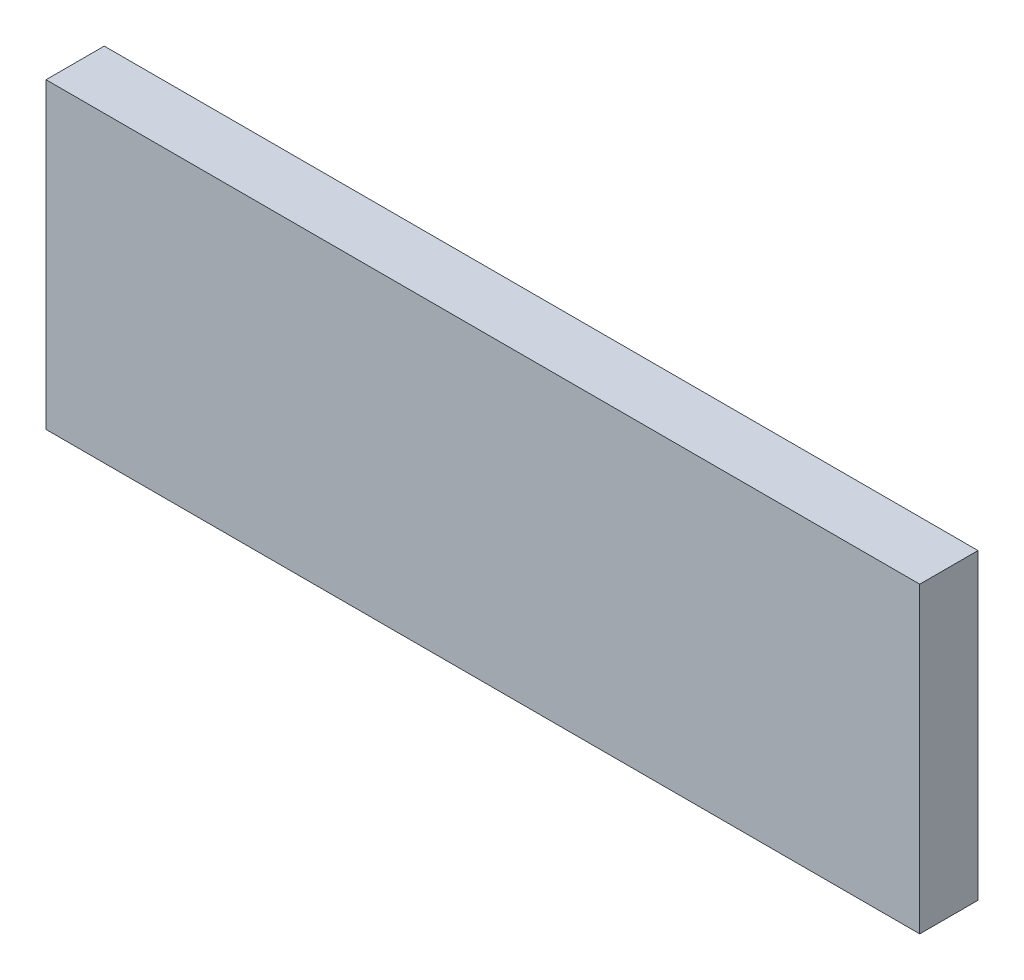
from build123d import *

# Parameters (mm, degrees)
SKIZZE1_W               = 150
SKIZZE1_H               = 52
LINEAR_AUSTRAGEN1_DEPTH = 10


with BuildPart() as part:
    # Skizze1 → Linear austragen1 (new body)
    with BuildSketch(Plane.XY):
        with Locations((7.171977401, 21.671581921)):
            Rectangle(SKIZZE1_W, SKIZZE1_H)
    extrude(amount=LINEAR_AUSTRAGEN1_DEPTH)


solid = part.part
